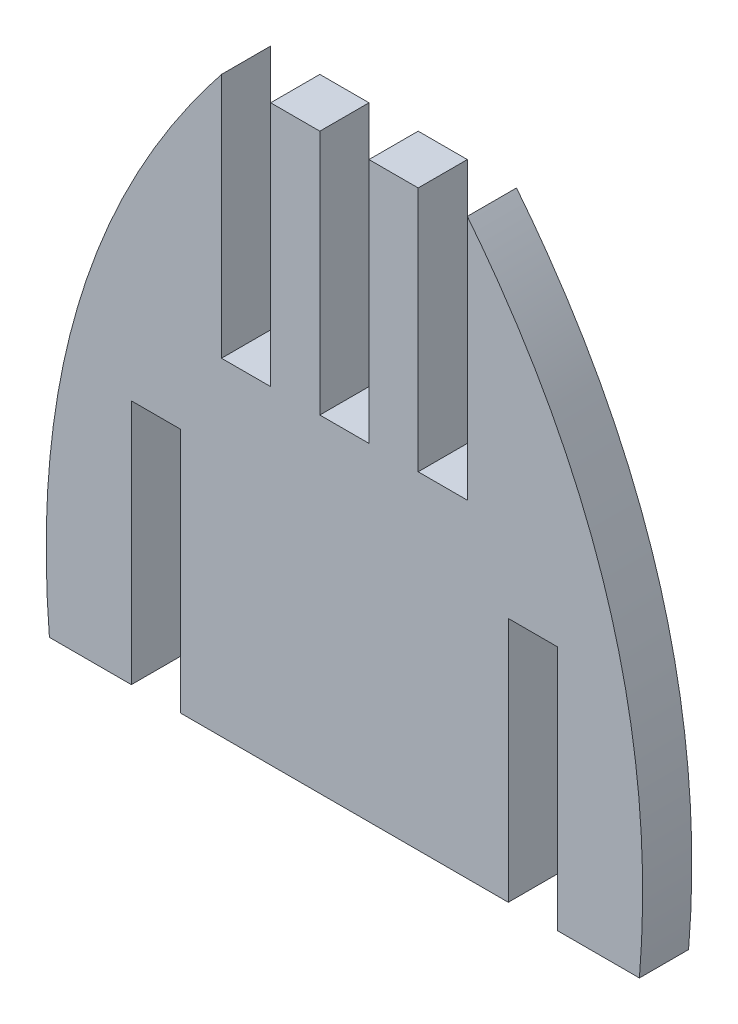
from build123d import *

# Parameters (mm, degrees)
SALIENTE_EXTRUIR1_DEPTH = 3


with BuildPart() as part:
    # Croquis1 → Saliente-Extruir1 (new body)
    with BuildSketch(Plane.XY):
        with BuildLine():
            Line((-15.898080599, -0.828022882), (-10.898080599, -0.828022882))
            Line((-10.898080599, -0.828022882), (-10.898080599, 14.171977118))
            Line((-10.898080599, 14.171977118), (-7.898080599, 14.171977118))
            Line((-7.898080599, 14.171977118), (-7.898080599, -0.828022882))
            Line((-7.898080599, -0.828022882), (12.101919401, -0.828022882))
            Line((12.101919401, -0.828022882), (12.101919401, 14.171977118))
            Line((12.101919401, 14.171977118), (15.101919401, 14.171977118))
            Line((15.101919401, 14.171977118), (15.101919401, -0.828022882))
            Line((15.101919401, -0.828022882), (20.101919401, -0.828022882))
            add(Edge.make_bspline(
                [(20.101919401, -0.828022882), (21.753247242, 18.863200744), (9.601919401, 34.171977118)],
                knots=[0, 0, 0, 1, 1, 1], degree=2))
            Line((9.601919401, 34.171977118), (9.601919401, 19.171977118))
            Line((9.601919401, 19.171977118), (6.601919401, 19.171977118))
            Line((6.601919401, 19.171977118), (6.601919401, 34.171977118))
            Line((6.601919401, 34.171977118), (3.601919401, 34.171977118))
            Line((3.601919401, 34.171977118), (3.601919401, 19.171977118))
            Line((3.601919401, 19.171977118), (0.601919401, 19.171977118))
            Line((0.601919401, 19.171977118), (0.601919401, 34.171977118))
            Line((0.601919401, 34.171977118), (-2.398080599, 34.171977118))
            Line((-2.398080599, 34.171977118), (-2.398080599, 19.171977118))
            Line((-2.398080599, 19.171977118), (-5.398080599, 19.171977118))
            Line((-5.398080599, 19.171977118), (-5.398080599, 34.171977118))
            add(Edge.make_bspline(
                [(-15.898080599, -0.828022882), (-17.54940844, 18.863200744), (-5.398080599, 34.171977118)],
                knots=[0, 0, 0, 1, 1, 1], degree=2))
        make_face()
    extrude(amount=SALIENTE_EXTRUIR1_DEPTH)


solid = part.part
